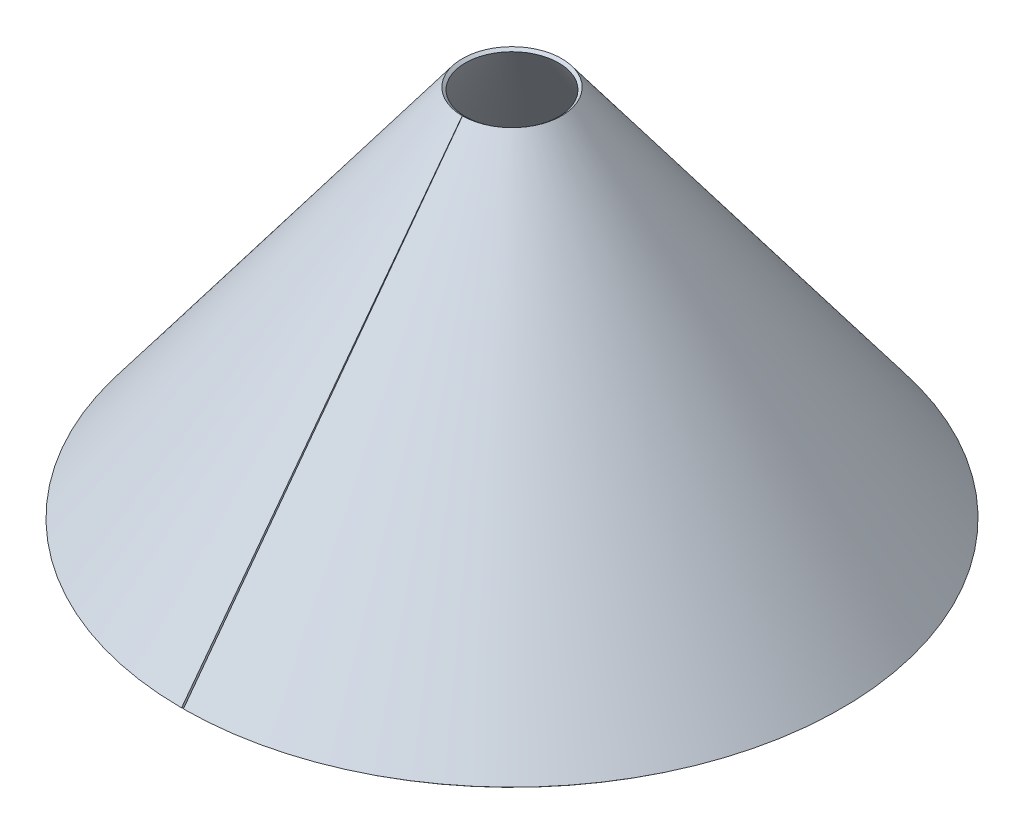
ISO-10303-21;
HEADER;
FILE_DESCRIPTION(('STEP AP214'),'2;1');
FILE_NAME('part.step','',(''),(''),'','','');
FILE_SCHEMA(('AUTOMOTIVE_DESIGN { 1 0 10303 214 1 1 1 1 }'));
ENDSEC;
DATA;
#1=APPLICATION_CONTEXT('core data for automotive mechanical design processes');
#2=APPLICATION_PROTOCOL_DEFINITION('international standard','automotive_design',2000,#1);
#3=PRODUCT_CONTEXT('',#1,'mechanical');
#4=PRODUCT('Part','Part','',(#3));
#5=PRODUCT_RELATED_PRODUCT_CATEGORY('part','',(#4));
#6=PRODUCT_DEFINITION_FORMATION('','',#4);
#7=PRODUCT_DEFINITION_CONTEXT('part definition',#1,'design');
#8=PRODUCT_DEFINITION('design','',#6,#7);
#9=PRODUCT_DEFINITION_SHAPE('','',#8);
#10=(LENGTH_UNIT() NAMED_UNIT(*) SI_UNIT(.MILLI.,.METRE.));
#11=(NAMED_UNIT(*) PLANE_ANGLE_UNIT() SI_UNIT($,.RADIAN.));
#12=(NAMED_UNIT(*) SI_UNIT($,.STERADIAN.) SOLID_ANGLE_UNIT());
#13=UNCERTAINTY_MEASURE_WITH_UNIT(LENGTH_MEASURE(1.E-05),#10,'distance_accuracy_value','');
#14=(GEOMETRIC_REPRESENTATION_CONTEXT(3) GLOBAL_UNCERTAINTY_ASSIGNED_CONTEXT((#13)) GLOBAL_UNIT_ASSIGNED_CONTEXT((#10,
#11,#12)) REPRESENTATION_CONTEXT('',''));
#15=CARTESIAN_POINT('',(0.,0.,0.));
#16=DIRECTION('',(0.,0.,1.));
#17=DIRECTION('',(1.,0.,0.));
#18=AXIS2_PLACEMENT_3D('',#15,#16,#17);
#19=CARTESIAN_POINT('',(-0.499999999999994,0.,174.999285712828));
#20=DIRECTION('',(0.999995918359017,0.,0.00285714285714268));
#21=DIRECTION('',(0.00171428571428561,0.8,-0.59999755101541));
#22=AXIS2_PLACEMENT_3D('',#19,#20,#21);
#23=PLANE('',#22);
#24=DIRECTION('',(-0.00228571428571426,0.6,0.799996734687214));
#25=VECTOR('',#24,1.);
#26=CARTESIAN_POINT('',(-0.499999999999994,0.,174.999285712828));
#27=LINE('',#26,#25);
#28=CARTESIAN_POINT('',(-0.499999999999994,0.,174.999285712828));
#29=VERTEX_POINT('',#28);
#30=CARTESIAN_POINT('',(-0.504571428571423,1.2,176.599279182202));
#31=VERTEX_POINT('',#30);
#32=EDGE_CURVE('E12',#29,#31,#27,.T.);
#33=ORIENTED_EDGE('',*,*,#32,.F.);
#34=DIRECTION('',(0.00171428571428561,0.8,-0.59999755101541));
#35=VECTOR('',#34,1.);
#36=CARTESIAN_POINT('',(-0.499999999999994,0.,174.999285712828));
#37=LINE('',#36,#35);
#38=CARTESIAN_POINT('',(-0.0714285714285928,200.,24.9998979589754));
#39=VERTEX_POINT('',#38);
#40=EDGE_CURVE('E85',#29,#39,#37,.T.);
#41=ORIENTED_EDGE('',*,*,#40,.T.);
#42=DIRECTION('',(-0.00228571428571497,0.6,0.799996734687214));
#43=VECTOR('',#42,1.);
#44=CARTESIAN_POINT('',(-0.0714285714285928,200.,24.9998979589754));
#45=LINE('',#44,#43);
#46=CARTESIAN_POINT('',(-0.0760000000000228,201.2,26.5998914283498));
#47=VERTEX_POINT('',#46);
#48=EDGE_CURVE('E41',#39,#47,#45,.T.);
#49=ORIENTED_EDGE('',*,*,#48,.T.);
#50=DIRECTION('',(-0.00171428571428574,-0.8,0.59999755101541));
#51=VECTOR('',#50,1.);
#52=CARTESIAN_POINT('',(-0.504571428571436,1.2,176.599279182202));
#53=LINE('',#52,#51);
#54=EDGE_CURVE('E97',#31,#47,#53,.F.);
#55=ORIENTED_EDGE('',*,*,#54,.F.);
#56=EDGE_LOOP('',(#33,#41,#49,#55));
#57=FACE_BOUND('',#56,.T.);
#58=ADVANCED_FACE('F31',(#57),#23,.T.);
#59=CARTESIAN_POINT('',(0.,200.,0.));
#60=DIRECTION('',(0.,1.,0.));
#61=DIRECTION('',(0.,0.,1.));
#62=AXIS2_PLACEMENT_3D('',#59,#60,#61);
#63=CONICAL_SURFACE('',#62,25.,0.927295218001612);
#64=ORIENTED_EDGE('',*,*,#48,.F.);
#65=CARTESIAN_POINT('',(0.,200.,0.));
#66=DIRECTION('',(0.,-1.,0.));
#67=DIRECTION('',(0.,0.,-1.));
#68=AXIS2_PLACEMENT_3D('',#65,#66,#67);
#69=CIRCLE('',#68,25.);
#70=CARTESIAN_POINT('',(0.0714285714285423,200.,24.9998979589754));
#71=VERTEX_POINT('',#70);
#72=EDGE_CURVE('E91',#39,#71,#69,.T.);
#73=ORIENTED_EDGE('',*,*,#72,.T.);
#74=DIRECTION('',(0.00228571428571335,0.6,0.799996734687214));
#75=VECTOR('',#74,1.);
#76=CARTESIAN_POINT('',(0.0714285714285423,200.,24.9998979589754));
#77=LINE('',#76,#75);
#78=CARTESIAN_POINT('',(0.075999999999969,201.2,26.5998914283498));
#79=VERTEX_POINT('',#78);
#80=EDGE_CURVE('E76',#71,#79,#77,.T.);
#81=ORIENTED_EDGE('',*,*,#80,.T.);
#82=CARTESIAN_POINT('',(0.,201.2,0.));
#83=DIRECTION('',(0.,-1.,0.));
#84=DIRECTION('',(0.,0.,-1.));
#85=AXIS2_PLACEMENT_3D('',#82,#83,#84);
#86=CIRCLE('',#85,26.6);
#87=EDGE_CURVE('E77',#47,#79,#86,.T.);
#88=ORIENTED_EDGE('',*,*,#87,.F.);
#89=EDGE_LOOP('',(#64,#73,#81,#88));
#90=FACE_BOUND('',#89,.T.);
#91=ADVANCED_FACE('F103',(#90),#63,.F.);
#92=CARTESIAN_POINT('',(0.499999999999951,0.,174.999285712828));
#93=DIRECTION('',(0.999995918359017,0.,-0.00285714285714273));
#94=DIRECTION('',(-0.00171428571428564,0.8,-0.59999755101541));
#95=AXIS2_PLACEMENT_3D('',#92,#93,#94);
#96=PLANE('',#95);
#97=ORIENTED_EDGE('',*,*,#80,.F.);
#98=DIRECTION('',(-0.00171428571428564,0.8,-0.59999755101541));
#99=VECTOR('',#98,1.);
#100=CARTESIAN_POINT('',(0.499999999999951,0.,174.999285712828));
#101=LINE('',#100,#99);
#102=CARTESIAN_POINT('',(0.499999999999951,0.,174.999285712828));
#103=VERTEX_POINT('',#102);
#104=EDGE_CURVE('E83',#103,#71,#101,.T.);
#105=ORIENTED_EDGE('',*,*,#104,.F.);
#106=DIRECTION('',(0.00228571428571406,0.6,0.799996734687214));
#107=VECTOR('',#106,1.);
#108=CARTESIAN_POINT('',(0.499999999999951,0.,174.999285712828));
#109=LINE('',#108,#107);
#110=CARTESIAN_POINT('',(0.50457142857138,1.2,176.599279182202));
#111=VERTEX_POINT('',#110);
#112=EDGE_CURVE('E35',#103,#111,#109,.T.);
#113=ORIENTED_EDGE('',*,*,#112,.T.);
#114=DIRECTION('',(0.00171428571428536,-0.8,0.59999755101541));
#115=VECTOR('',#114,1.);
#116=CARTESIAN_POINT('',(0.504571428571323,1.2,176.599279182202));
#117=LINE('',#116,#115);
#118=EDGE_CURVE('E92',#111,#79,#117,.F.);
#119=ORIENTED_EDGE('',*,*,#118,.T.);
#120=EDGE_LOOP('',(#97,#105,#113,#119));
#121=FACE_BOUND('',#120,.T.);
#122=ADVANCED_FACE('F87',(#121),#96,.F.);
#123=CARTESIAN_POINT('',(0.,0.,0.));
#124=DIRECTION('',(0.,1.,0.));
#125=DIRECTION('',(0.,0.,1.));
#126=AXIS2_PLACEMENT_3D('',#123,#124,#125);
#127=CONICAL_SURFACE('',#126,175.,0.927295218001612);
#128=CARTESIAN_POINT('',(0.,0.,0.));
#129=DIRECTION('',(0.,-1.,0.));
#130=DIRECTION('',(0.,0.,-1.));
#131=AXIS2_PLACEMENT_3D('',#128,#129,#130);
#132=CIRCLE('',#131,175.);
#133=EDGE_CURVE('E69',#29,#103,#132,.T.);
#134=ORIENTED_EDGE('',*,*,#133,.F.);
#135=ORIENTED_EDGE('',*,*,#32,.T.);
#136=CARTESIAN_POINT('',(0.,1.2,0.));
#137=DIRECTION('',(0.,-1.,0.));
#138=DIRECTION('',(0.,0.,-1.));
#139=AXIS2_PLACEMENT_3D('',#136,#137,#138);
#140=CIRCLE('',#139,176.6);
#141=EDGE_CURVE('E71',#31,#111,#140,.T.);
#142=ORIENTED_EDGE('',*,*,#141,.T.);
#143=ORIENTED_EDGE('',*,*,#112,.F.);
#144=EDGE_LOOP('',(#134,#135,#142,#143));
#145=FACE_BOUND('',#144,.T.);
#146=ADVANCED_FACE('F33',(#145),#127,.T.);
#147=CARTESIAN_POINT('',(0.,1.2,0.));
#148=DIRECTION('',(0.,-1.,0.));
#149=DIRECTION('',(0.,0.,-1.));
#150=AXIS2_PLACEMENT_3D('',#147,#148,#149);
#151=CONICAL_SURFACE('',#150,176.6,0.643501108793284);
#152=ORIENTED_EDGE('',*,*,#118,.F.);
#153=ORIENTED_EDGE('',*,*,#141,.F.);
#154=ORIENTED_EDGE('',*,*,#54,.T.);
#155=ORIENTED_EDGE('',*,*,#87,.T.);
#156=EDGE_LOOP('',(#152,#153,#154,#155));
#157=FACE_BOUND('',#156,.T.);
#158=ADVANCED_FACE('F105',(#157),#151,.T.);
#159=CARTESIAN_POINT('',(0.,0.,0.));
#160=DIRECTION('',(0.,-1.,0.));
#161=DIRECTION('',(0.,0.,-1.));
#162=AXIS2_PLACEMENT_3D('',#159,#160,#161);
#163=CONICAL_SURFACE('',#162,175.,0.643501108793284);
#164=ORIENTED_EDGE('',*,*,#104,.T.);
#165=ORIENTED_EDGE('',*,*,#72,.F.);
#166=ORIENTED_EDGE('',*,*,#40,.F.);
#167=ORIENTED_EDGE('',*,*,#133,.T.);
#168=EDGE_LOOP('',(#164,#165,#166,#167));
#169=FACE_BOUND('',#168,.T.);
#170=ADVANCED_FACE('F81',(#169),#163,.F.);
#171=CLOSED_SHELL('',(#58,#91,#122,#146,#158,#170));
#172=MANIFOLD_SOLID_BREP('B2',#171);
#173=ADVANCED_BREP_SHAPE_REPRESENTATION('',(#18,#172),#14);
#174=SHAPE_DEFINITION_REPRESENTATION(#9,#173);
ENDSEC;
END-ISO-10303-21;
